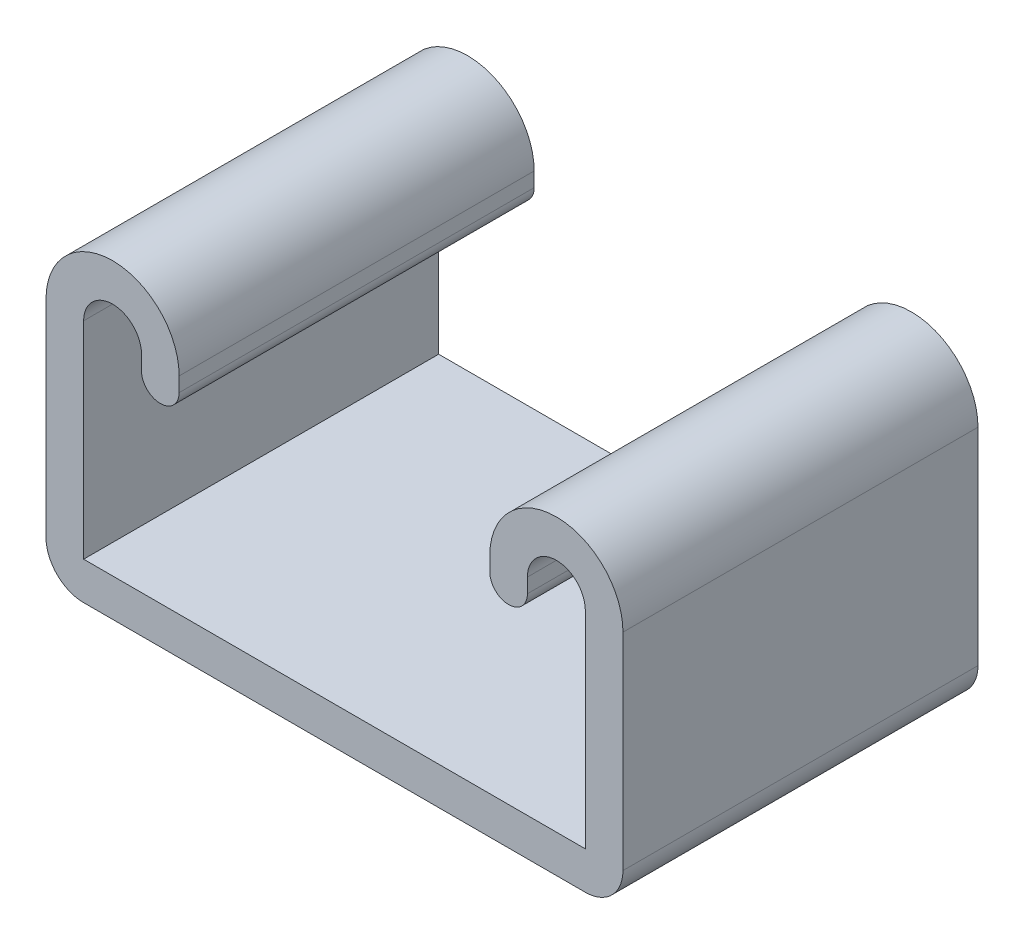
ISO-10303-21;
HEADER;
FILE_DESCRIPTION(('STEP AP214'),'2;1');
FILE_NAME('part.step','',(''),(''),'','','');
FILE_SCHEMA(('AUTOMOTIVE_DESIGN { 1 0 10303 214 1 1 1 1 }'));
ENDSEC;
DATA;
#1=APPLICATION_CONTEXT('core data for automotive mechanical design processes');
#2=APPLICATION_PROTOCOL_DEFINITION('international standard','automotive_design',2000,#1);
#3=PRODUCT_CONTEXT('',#1,'mechanical');
#4=PRODUCT('Part','Part','',(#3));
#5=PRODUCT_RELATED_PRODUCT_CATEGORY('part','',(#4));
#6=PRODUCT_DEFINITION_FORMATION('','',#4);
#7=PRODUCT_DEFINITION_CONTEXT('part definition',#1,'design');
#8=PRODUCT_DEFINITION('design','',#6,#7);
#9=PRODUCT_DEFINITION_SHAPE('','',#8);
#10=(LENGTH_UNIT() NAMED_UNIT(*) SI_UNIT(.MILLI.,.METRE.));
#11=(NAMED_UNIT(*) PLANE_ANGLE_UNIT() SI_UNIT($,.RADIAN.));
#12=(NAMED_UNIT(*) SI_UNIT($,.STERADIAN.) SOLID_ANGLE_UNIT());
#13=UNCERTAINTY_MEASURE_WITH_UNIT(LENGTH_MEASURE(1.E-05),#10,'distance_accuracy_value','');
#14=(GEOMETRIC_REPRESENTATION_CONTEXT(3) GLOBAL_UNCERTAINTY_ASSIGNED_CONTEXT((#13)) GLOBAL_UNIT_ASSIGNED_CONTEXT((#10,
#11,#12)) REPRESENTATION_CONTEXT('',''));
#15=CARTESIAN_POINT('',(0.,0.,0.));
#16=DIRECTION('',(0.,0.,1.));
#17=DIRECTION('',(1.,0.,0.));
#18=AXIS2_PLACEMENT_3D('',#15,#16,#17);
#19=CARTESIAN_POINT('',(-15.875,8.3693,12.7));
#20=DIRECTION('',(0.,0.,-1.));
#21=DIRECTION('',(-1.,0.,0.));
#22=AXIS2_PLACEMENT_3D('',#19,#20,#21);
#23=CYLINDRICAL_SURFACE('',#22,4.7625);
#24=CARTESIAN_POINT('',(-15.875,8.3693,-12.7));
#25=DIRECTION('',(0.,0.,1.));
#26=DIRECTION('',(-1.,0.,0.));
#27=AXIS2_PLACEMENT_3D('',#24,#25,#26);
#28=CIRCLE('',#27,4.7625);
#29=CARTESIAN_POINT('',(-11.1125,8.3693,-12.7));
#30=VERTEX_POINT('',#29);
#31=CARTESIAN_POINT('',(-20.6375,8.3693,-12.7));
#32=VERTEX_POINT('',#31);
#33=EDGE_CURVE('E189',#30,#32,#28,.T.);
#34=ORIENTED_EDGE('',*,*,#33,.T.);
#35=DIRECTION('',(0.,0.,-1.));
#36=VECTOR('',#35,1.);
#37=CARTESIAN_POINT('',(-20.6375,8.3693,12.7));
#38=LINE('',#37,#36);
#39=CARTESIAN_POINT('',(-20.6375,8.3693,12.7));
#40=VERTEX_POINT('',#39);
#41=EDGE_CURVE('E11',#40,#32,#38,.T.);
#42=ORIENTED_EDGE('',*,*,#41,.F.);
#43=CARTESIAN_POINT('',(-15.875,8.3693,12.7));
#44=DIRECTION('',(0.,0.,1.));
#45=DIRECTION('',(-1.,0.,0.));
#46=AXIS2_PLACEMENT_3D('',#43,#44,#45);
#47=CIRCLE('',#46,4.7625);
#48=CARTESIAN_POINT('',(-11.1125,8.3693,12.7));
#49=VERTEX_POINT('',#48);
#50=EDGE_CURVE('E223',#49,#40,#47,.T.);
#51=ORIENTED_EDGE('',*,*,#50,.F.);
#52=DIRECTION('',(0.,0.,-1.));
#53=VECTOR('',#52,1.);
#54=CARTESIAN_POINT('',(-11.1125,8.3693,12.7));
#55=LINE('',#54,#53);
#56=EDGE_CURVE('E185',#49,#30,#55,.T.);
#57=ORIENTED_EDGE('',*,*,#56,.T.);
#58=EDGE_LOOP('',(#34,#42,#51,#57));
#59=FACE_BOUND('',#58,.T.);
#60=ADVANCED_FACE('F33',(#59),#23,.T.);
#61=CARTESIAN_POINT('',(-20.6375,8.3693,12.7));
#62=DIRECTION('',(1.,0.,0.));
#63=DIRECTION('',(0.,1.,0.));
#64=AXIS2_PLACEMENT_3D('',#61,#62,#63);
#65=PLANE('',#64);
#66=DIRECTION('',(0.,-1.,0.));
#67=VECTOR('',#66,1.);
#68=CARTESIAN_POINT('',(-20.6375,8.3693,-12.7));
#69=LINE('',#68,#67);
#70=CARTESIAN_POINT('',(-20.6375,-6.4008,-12.7));
#71=VERTEX_POINT('',#70);
#72=EDGE_CURVE('E192',#32,#71,#69,.T.);
#73=ORIENTED_EDGE('',*,*,#72,.T.);
#74=DIRECTION('',(0.,0.,-1.));
#75=VECTOR('',#74,1.);
#76=CARTESIAN_POINT('',(-20.6375,-6.4008,12.7));
#77=LINE('',#76,#75);
#78=CARTESIAN_POINT('',(-20.6375,-6.4008,12.7));
#79=VERTEX_POINT('',#78);
#80=EDGE_CURVE('E41',#79,#71,#77,.T.);
#81=ORIENTED_EDGE('',*,*,#80,.F.);
#82=DIRECTION('',(0.,-1.,0.));
#83=VECTOR('',#82,1.);
#84=CARTESIAN_POINT('',(-20.6375,8.3693,12.7));
#85=LINE('',#84,#83);
#86=EDGE_CURVE('E122',#40,#79,#85,.T.);
#87=ORIENTED_EDGE('',*,*,#86,.F.);
#88=ORIENTED_EDGE('',*,*,#41,.T.);
#89=EDGE_LOOP('',(#73,#81,#87,#88));
#90=FACE_BOUND('',#89,.T.);
#91=ADVANCED_FACE('F331',(#90),#65,.F.);
#92=CARTESIAN_POINT('',(-17.9451,-6.4008,12.7));
#93=DIRECTION('',(0.,0.,-1.));
#94=DIRECTION('',(-1.,0.,0.));
#95=AXIS2_PLACEMENT_3D('',#92,#93,#94);
#96=CYLINDRICAL_SURFACE('',#95,2.6924);
#97=CARTESIAN_POINT('',(-17.9451,-6.4008,-12.7));
#98=DIRECTION('',(0.,0.,1.));
#99=DIRECTION('',(-1.,0.,0.));
#100=AXIS2_PLACEMENT_3D('',#97,#98,#99);
#101=CIRCLE('',#100,2.6924);
#102=CARTESIAN_POINT('',(-17.9451,-9.0932,-12.7));
#103=VERTEX_POINT('',#102);
#104=EDGE_CURVE('E194',#71,#103,#101,.T.);
#105=ORIENTED_EDGE('',*,*,#104,.T.);
#106=DIRECTION('',(0.,0.,-1.));
#107=VECTOR('',#106,1.);
#108=CARTESIAN_POINT('',(-17.9451,-9.0932,12.7));
#109=LINE('',#108,#107);
#110=CARTESIAN_POINT('',(-17.9451,-9.0932,12.7));
#111=VERTEX_POINT('',#110);
#112=EDGE_CURVE('E260',#111,#103,#109,.T.);
#113=ORIENTED_EDGE('',*,*,#112,.F.);
#114=CARTESIAN_POINT('',(-17.9451,-6.4008,12.7));
#115=DIRECTION('',(0.,0.,1.));
#116=DIRECTION('',(-1.,0.,0.));
#117=AXIS2_PLACEMENT_3D('',#114,#115,#116);
#118=CIRCLE('',#117,2.6924);
#119=EDGE_CURVE('E268',#79,#111,#118,.T.);
#120=ORIENTED_EDGE('',*,*,#119,.F.);
#121=ORIENTED_EDGE('',*,*,#80,.T.);
#122=EDGE_LOOP('',(#105,#113,#120,#121));
#123=FACE_BOUND('',#122,.T.);
#124=ADVANCED_FACE('F266',(#123),#96,.T.);
#125=CARTESIAN_POINT('',(-17.9451,-9.0932,12.7));
#126=DIRECTION('',(0.,1.,0.));
#127=DIRECTION('',(0.,0.,1.));
#128=AXIS2_PLACEMENT_3D('',#125,#126,#127);
#129=PLANE('',#128);
#130=DIRECTION('',(1.,0.,0.));
#131=VECTOR('',#130,1.);
#132=CARTESIAN_POINT('',(-17.9451,-9.0932,-12.7));
#133=LINE('',#132,#131);
#134=CARTESIAN_POINT('',(17.9451,-9.0932,-12.7));
#135=VERTEX_POINT('',#134);
#136=EDGE_CURVE('E196',#103,#135,#133,.T.);
#137=ORIENTED_EDGE('',*,*,#136,.T.);
#138=DIRECTION('',(0.,0.,-1.));
#139=VECTOR('',#138,1.);
#140=CARTESIAN_POINT('',(17.9451,-9.0932,12.7));
#141=LINE('',#140,#139);
#142=CARTESIAN_POINT('',(17.9451,-9.0932,12.7));
#143=VERTEX_POINT('',#142);
#144=EDGE_CURVE('E257',#143,#135,#141,.T.);
#145=ORIENTED_EDGE('',*,*,#144,.F.);
#146=DIRECTION('',(1.,0.,0.));
#147=VECTOR('',#146,1.);
#148=CARTESIAN_POINT('',(-17.9451,-9.0932,12.7));
#149=LINE('',#148,#147);
#150=EDGE_CURVE('E286',#111,#143,#149,.T.);
#151=ORIENTED_EDGE('',*,*,#150,.F.);
#152=ORIENTED_EDGE('',*,*,#112,.T.);
#153=EDGE_LOOP('',(#137,#145,#151,#152));
#154=FACE_BOUND('',#153,.T.);
#155=ADVANCED_FACE('F277',(#154),#129,.F.);
#156=CARTESIAN_POINT('',(17.9451,-6.4008,12.7));
#157=DIRECTION('',(0.,0.,-1.));
#158=DIRECTION('',(-1.,0.,0.));
#159=AXIS2_PLACEMENT_3D('',#156,#157,#158);
#160=CYLINDRICAL_SURFACE('',#159,2.6924);
#161=CARTESIAN_POINT('',(17.9451,-6.4008,-12.7));
#162=DIRECTION('',(0.,0.,1.));
#163=DIRECTION('',(1.,0.,0.));
#164=AXIS2_PLACEMENT_3D('',#161,#162,#163);
#165=CIRCLE('',#164,2.6924);
#166=CARTESIAN_POINT('',(20.6375,-6.4008,-12.7));
#167=VERTEX_POINT('',#166);
#168=EDGE_CURVE('E198',#135,#167,#165,.T.);
#169=ORIENTED_EDGE('',*,*,#168,.T.);
#170=DIRECTION('',(0.,0.,-1.));
#171=VECTOR('',#170,1.);
#172=CARTESIAN_POINT('',(20.6375,-6.4008,12.7));
#173=LINE('',#172,#171);
#174=CARTESIAN_POINT('',(20.6375,-6.4008,12.7));
#175=VERTEX_POINT('',#174);
#176=EDGE_CURVE('E254',#175,#167,#173,.T.);
#177=ORIENTED_EDGE('',*,*,#176,.F.);
#178=CARTESIAN_POINT('',(17.9451,-6.4008,12.7));
#179=DIRECTION('',(0.,0.,1.));
#180=DIRECTION('',(1.,0.,0.));
#181=AXIS2_PLACEMENT_3D('',#178,#179,#180);
#182=CIRCLE('',#181,2.6924);
#183=EDGE_CURVE('E283',#143,#175,#182,.T.);
#184=ORIENTED_EDGE('',*,*,#183,.F.);
#185=ORIENTED_EDGE('',*,*,#144,.T.);
#186=EDGE_LOOP('',(#169,#177,#184,#185));
#187=FACE_BOUND('',#186,.T.);
#188=ADVANCED_FACE('F281',(#187),#160,.T.);
#189=CARTESIAN_POINT('',(20.6375,-6.4008,12.7));
#190=DIRECTION('',(-1.,0.,0.));
#191=DIRECTION('',(0.,-1.,0.));
#192=AXIS2_PLACEMENT_3D('',#189,#190,#191);
#193=PLANE('',#192);
#194=DIRECTION('',(0.,1.,0.));
#195=VECTOR('',#194,1.);
#196=CARTESIAN_POINT('',(20.6375,-6.4008,-12.7));
#197=LINE('',#196,#195);
#198=CARTESIAN_POINT('',(20.6375,8.3693,-12.7));
#199=VERTEX_POINT('',#198);
#200=EDGE_CURVE('E200',#167,#199,#197,.T.);
#201=ORIENTED_EDGE('',*,*,#200,.T.);
#202=DIRECTION('',(0.,0.,-1.));
#203=VECTOR('',#202,1.);
#204=CARTESIAN_POINT('',(20.6375,8.3693,12.7));
#205=LINE('',#204,#203);
#206=CARTESIAN_POINT('',(20.6375,8.3693,12.7));
#207=VERTEX_POINT('',#206);
#208=EDGE_CURVE('E251',#207,#199,#205,.T.);
#209=ORIENTED_EDGE('',*,*,#208,.F.);
#210=DIRECTION('',(0.,1.,0.));
#211=VECTOR('',#210,1.);
#212=CARTESIAN_POINT('',(20.6375,-6.4008,12.7));
#213=LINE('',#212,#211);
#214=EDGE_CURVE('E285',#175,#207,#213,.T.);
#215=ORIENTED_EDGE('',*,*,#214,.F.);
#216=ORIENTED_EDGE('',*,*,#176,.T.);
#217=EDGE_LOOP('',(#201,#209,#215,#216));
#218=FACE_BOUND('',#217,.T.);
#219=ADVANCED_FACE('F344',(#218),#193,.F.);
#220=CARTESIAN_POINT('',(15.875,8.3693,12.7));
#221=DIRECTION('',(0.,0.,-1.));
#222=DIRECTION('',(-1.,0.,0.));
#223=AXIS2_PLACEMENT_3D('',#220,#221,#222);
#224=CYLINDRICAL_SURFACE('',#223,4.7625);
#225=CARTESIAN_POINT('',(15.875,8.3693,-12.7));
#226=DIRECTION('',(0.,0.,1.));
#227=DIRECTION('',(1.,0.,0.));
#228=AXIS2_PLACEMENT_3D('',#225,#226,#227);
#229=CIRCLE('',#228,4.7625);
#230=CARTESIAN_POINT('',(11.1125,8.3693,-12.7));
#231=VERTEX_POINT('',#230);
#232=EDGE_CURVE('E202',#199,#231,#229,.T.);
#233=ORIENTED_EDGE('',*,*,#232,.T.);
#234=DIRECTION('',(0.,0.,-1.));
#235=VECTOR('',#234,1.);
#236=CARTESIAN_POINT('',(11.1125,8.3693,12.7));
#237=LINE('',#236,#235);
#238=CARTESIAN_POINT('',(11.1125,8.3693,12.7));
#239=VERTEX_POINT('',#238);
#240=EDGE_CURVE('E248',#239,#231,#237,.T.);
#241=ORIENTED_EDGE('',*,*,#240,.F.);
#242=CARTESIAN_POINT('',(15.875,8.3693,12.7));
#243=DIRECTION('',(0.,0.,1.));
#244=DIRECTION('',(1.,0.,0.));
#245=AXIS2_PLACEMENT_3D('',#242,#243,#244);
#246=CIRCLE('',#245,4.7625);
#247=EDGE_CURVE('E288',#207,#239,#246,.T.);
#248=ORIENTED_EDGE('',*,*,#247,.F.);
#249=ORIENTED_EDGE('',*,*,#208,.T.);
#250=EDGE_LOOP('',(#233,#241,#248,#249));
#251=FACE_BOUND('',#250,.T.);
#252=ADVANCED_FACE('F347',(#251),#224,.T.);
#253=CARTESIAN_POINT('',(11.1125,8.3693,12.7));
#254=DIRECTION('',(1.,0.,0.));
#255=DIRECTION('',(0.,0.,-1.));
#256=AXIS2_PLACEMENT_3D('',#253,#254,#255);
#257=PLANE('',#256);
#258=DIRECTION('',(0.,-1.,0.));
#259=VECTOR('',#258,1.);
#260=CARTESIAN_POINT('',(11.1125,8.3693,-12.7));
#261=LINE('',#260,#259);
#262=CARTESIAN_POINT('',(11.1125,7.33425,-12.7));
#263=VERTEX_POINT('',#262);
#264=EDGE_CURVE('E204',#231,#263,#261,.T.);
#265=ORIENTED_EDGE('',*,*,#264,.T.);
#266=DIRECTION('',(0.,0.,-1.));
#267=VECTOR('',#266,1.);
#268=CARTESIAN_POINT('',(11.1125,7.33425,12.7));
#269=LINE('',#268,#267);
#270=CARTESIAN_POINT('',(11.1125,7.33425,12.7));
#271=VERTEX_POINT('',#270);
#272=EDGE_CURVE('E245',#271,#263,#269,.T.);
#273=ORIENTED_EDGE('',*,*,#272,.F.);
#274=DIRECTION('',(0.,-1.,0.));
#275=VECTOR('',#274,1.);
#276=CARTESIAN_POINT('',(11.1125,8.3693,12.7));
#277=LINE('',#276,#275);
#278=EDGE_CURVE('E294',#239,#271,#277,.T.);
#279=ORIENTED_EDGE('',*,*,#278,.F.);
#280=ORIENTED_EDGE('',*,*,#240,.T.);
#281=EDGE_LOOP('',(#265,#273,#279,#280));
#282=FACE_BOUND('',#281,.T.);
#283=ADVANCED_FACE('F351',(#282),#257,.F.);
#284=CARTESIAN_POINT('',(12.4587,7.33425,12.7));
#285=DIRECTION('',(0.,0.,-1.));
#286=DIRECTION('',(-1.,0.,0.));
#287=AXIS2_PLACEMENT_3D('',#284,#285,#286);
#288=CYLINDRICAL_SURFACE('',#287,1.3462);
#289=CARTESIAN_POINT('',(12.4587,7.33425,-12.7));
#290=DIRECTION('',(0.,0.,1.));
#291=DIRECTION('',(1.,0.,0.));
#292=AXIS2_PLACEMENT_3D('',#289,#290,#291);
#293=CIRCLE('',#292,1.3462);
#294=CARTESIAN_POINT('',(13.8049,7.33425,-12.7));
#295=VERTEX_POINT('',#294);
#296=EDGE_CURVE('E206',#263,#295,#293,.T.);
#297=ORIENTED_EDGE('',*,*,#296,.T.);
#298=DIRECTION('',(0.,0.,-1.));
#299=VECTOR('',#298,1.);
#300=CARTESIAN_POINT('',(13.8049,7.33425,12.7));
#301=LINE('',#300,#299);
#302=CARTESIAN_POINT('',(13.8049,7.33425,12.7));
#303=VERTEX_POINT('',#302);
#304=EDGE_CURVE('E242',#303,#295,#301,.T.);
#305=ORIENTED_EDGE('',*,*,#304,.F.);
#306=CARTESIAN_POINT('',(12.4587,7.33425,12.7));
#307=DIRECTION('',(0.,0.,1.));
#308=DIRECTION('',(1.,0.,0.));
#309=AXIS2_PLACEMENT_3D('',#306,#307,#308);
#310=CIRCLE('',#309,1.3462);
#311=EDGE_CURVE('E296',#271,#303,#310,.T.);
#312=ORIENTED_EDGE('',*,*,#311,.F.);
#313=ORIENTED_EDGE('',*,*,#272,.T.);
#314=EDGE_LOOP('',(#297,#305,#312,#313));
#315=FACE_BOUND('',#314,.T.);
#316=ADVANCED_FACE('F355',(#315),#288,.T.);
#317=CARTESIAN_POINT('',(13.8049,8.3693,12.7));
#318=DIRECTION('',(-1.,0.,0.));
#319=DIRECTION('',(0.,0.,1.));
#320=AXIS2_PLACEMENT_3D('',#317,#318,#319);
#321=PLANE('',#320);
#322=DIRECTION('',(0.,1.,0.));
#323=VECTOR('',#322,1.);
#324=CARTESIAN_POINT('',(13.8049,8.3693,-12.7));
#325=LINE('',#324,#323);
#326=CARTESIAN_POINT('',(13.8049,8.3693,-12.7));
#327=VERTEX_POINT('',#326);
#328=EDGE_CURVE('E208',#295,#327,#325,.T.);
#329=ORIENTED_EDGE('',*,*,#328,.T.);
#330=DIRECTION('',(0.,0.,-1.));
#331=VECTOR('',#330,1.);
#332=CARTESIAN_POINT('',(13.8049,8.3693,12.7));
#333=LINE('',#332,#331);
#334=CARTESIAN_POINT('',(13.8049,8.3693,12.7));
#335=VERTEX_POINT('',#334);
#336=EDGE_CURVE('E239',#335,#327,#333,.T.);
#337=ORIENTED_EDGE('',*,*,#336,.F.);
#338=DIRECTION('',(0.,1.,0.));
#339=VECTOR('',#338,1.);
#340=CARTESIAN_POINT('',(13.8049,8.3693,12.7));
#341=LINE('',#340,#339);
#342=EDGE_CURVE('E298',#303,#335,#341,.T.);
#343=ORIENTED_EDGE('',*,*,#342,.F.);
#344=ORIENTED_EDGE('',*,*,#304,.T.);
#345=EDGE_LOOP('',(#329,#337,#343,#344));
#346=FACE_BOUND('',#345,.T.);
#347=ADVANCED_FACE('F359',(#346),#321,.F.);
#348=CARTESIAN_POINT('',(15.875,8.3693,12.7));
#349=DIRECTION('',(0.,0.,-1.));
#350=DIRECTION('',(-1.,0.,0.));
#351=AXIS2_PLACEMENT_3D('',#348,#349,#350);
#352=CYLINDRICAL_SURFACE('',#351,2.0701);
#353=CARTESIAN_POINT('',(15.875,8.3693,-12.7));
#354=DIRECTION('',(0.,0.,-1.));
#355=DIRECTION('',(1.,0.,0.));
#356=AXIS2_PLACEMENT_3D('',#353,#354,#355);
#357=CIRCLE('',#356,2.0701);
#358=CARTESIAN_POINT('',(17.9451,8.3693,-12.7));
#359=VERTEX_POINT('',#358);
#360=EDGE_CURVE('E210',#327,#359,#357,.T.);
#361=ORIENTED_EDGE('',*,*,#360,.T.);
#362=DIRECTION('',(0.,0.,-1.));
#363=VECTOR('',#362,1.);
#364=CARTESIAN_POINT('',(17.9451,8.3693,12.7));
#365=LINE('',#364,#363);
#366=CARTESIAN_POINT('',(17.9451,8.3693,12.7));
#367=VERTEX_POINT('',#366);
#368=EDGE_CURVE('E236',#367,#359,#365,.T.);
#369=ORIENTED_EDGE('',*,*,#368,.F.);
#370=CARTESIAN_POINT('',(15.875,8.3693,12.7));
#371=DIRECTION('',(0.,0.,-1.));
#372=DIRECTION('',(1.,0.,0.));
#373=AXIS2_PLACEMENT_3D('',#370,#371,#372);
#374=CIRCLE('',#373,2.0701);
#375=EDGE_CURVE('E300',#335,#367,#374,.T.);
#376=ORIENTED_EDGE('',*,*,#375,.F.);
#377=ORIENTED_EDGE('',*,*,#336,.T.);
#378=EDGE_LOOP('',(#361,#369,#376,#377));
#379=FACE_BOUND('',#378,.T.);
#380=ADVANCED_FACE('F363',(#379),#352,.F.);
#381=CARTESIAN_POINT('',(17.9451,-6.4008,12.7));
#382=DIRECTION('',(1.,0.,0.));
#383=DIRECTION('',(0.,1.,0.));
#384=AXIS2_PLACEMENT_3D('',#381,#382,#383);
#385=PLANE('',#384);
#386=DIRECTION('',(0.,-1.,0.));
#387=VECTOR('',#386,1.);
#388=CARTESIAN_POINT('',(17.9451,-6.4008,-12.7));
#389=LINE('',#388,#387);
#390=CARTESIAN_POINT('',(17.9451,-6.4008,-12.7));
#391=VERTEX_POINT('',#390);
#392=EDGE_CURVE('E212',#359,#391,#389,.T.);
#393=ORIENTED_EDGE('',*,*,#392,.T.);
#394=DIRECTION('',(0.,0.,-1.));
#395=VECTOR('',#394,1.);
#396=CARTESIAN_POINT('',(17.9451,-6.4008,12.7));
#397=LINE('',#396,#395);
#398=CARTESIAN_POINT('',(17.9451,-6.4008,12.7));
#399=VERTEX_POINT('',#398);
#400=EDGE_CURVE('E233',#399,#391,#397,.T.);
#401=ORIENTED_EDGE('',*,*,#400,.F.);
#402=DIRECTION('',(0.,-1.,0.));
#403=VECTOR('',#402,1.);
#404=CARTESIAN_POINT('',(17.9451,-6.4008,12.7));
#405=LINE('',#404,#403);
#406=EDGE_CURVE('E302',#367,#399,#405,.T.);
#407=ORIENTED_EDGE('',*,*,#406,.F.);
#408=ORIENTED_EDGE('',*,*,#368,.T.);
#409=EDGE_LOOP('',(#393,#401,#407,#408));
#410=FACE_BOUND('',#409,.T.);
#411=ADVANCED_FACE('F367',(#410),#385,.F.);
#412=CARTESIAN_POINT('',(-17.9451,-6.4008,12.7));
#413=DIRECTION('',(0.,-1.,0.));
#414=DIRECTION('',(0.,0.,-1.));
#415=AXIS2_PLACEMENT_3D('',#412,#413,#414);
#416=PLANE('',#415);
#417=DIRECTION('',(-1.,0.,0.));
#418=VECTOR('',#417,1.);
#419=CARTESIAN_POINT('',(-17.9451,-6.4008,-12.7));
#420=LINE('',#419,#418);
#421=CARTESIAN_POINT('',(-17.9451,-6.4008,-12.7));
#422=VERTEX_POINT('',#421);
#423=EDGE_CURVE('E214',#391,#422,#420,.T.);
#424=ORIENTED_EDGE('',*,*,#423,.T.);
#425=DIRECTION('',(0.,0.,-1.));
#426=VECTOR('',#425,1.);
#427=CARTESIAN_POINT('',(-17.9451,-6.4008,12.7));
#428=LINE('',#427,#426);
#429=CARTESIAN_POINT('',(-17.9451,-6.4008,12.7));
#430=VERTEX_POINT('',#429);
#431=EDGE_CURVE('E230',#430,#422,#428,.T.);
#432=ORIENTED_EDGE('',*,*,#431,.F.);
#433=DIRECTION('',(-1.,0.,0.));
#434=VECTOR('',#433,1.);
#435=CARTESIAN_POINT('',(-17.9451,-6.4008,12.7));
#436=LINE('',#435,#434);
#437=EDGE_CURVE('E304',#399,#430,#436,.T.);
#438=ORIENTED_EDGE('',*,*,#437,.F.);
#439=ORIENTED_EDGE('',*,*,#400,.T.);
#440=EDGE_LOOP('',(#424,#432,#438,#439));
#441=FACE_BOUND('',#440,.T.);
#442=ADVANCED_FACE('F371',(#441),#416,.F.);
#443=CARTESIAN_POINT('',(-17.9451,8.3693,12.7));
#444=DIRECTION('',(-1.,0.,0.));
#445=DIRECTION('',(0.,-1.,0.));
#446=AXIS2_PLACEMENT_3D('',#443,#444,#445);
#447=PLANE('',#446);
#448=DIRECTION('',(0.,1.,0.));
#449=VECTOR('',#448,1.);
#450=CARTESIAN_POINT('',(-17.9451,8.3693,-12.7));
#451=LINE('',#450,#449);
#452=CARTESIAN_POINT('',(-17.9451,8.3693,-12.7));
#453=VERTEX_POINT('',#452);
#454=EDGE_CURVE('E216',#422,#453,#451,.T.);
#455=ORIENTED_EDGE('',*,*,#454,.T.);
#456=DIRECTION('',(0.,0.,-1.));
#457=VECTOR('',#456,1.);
#458=CARTESIAN_POINT('',(-17.9451,8.3693,12.7));
#459=LINE('',#458,#457);
#460=CARTESIAN_POINT('',(-17.9451,8.3693,12.7));
#461=VERTEX_POINT('',#460);
#462=EDGE_CURVE('E227',#461,#453,#459,.T.);
#463=ORIENTED_EDGE('',*,*,#462,.F.);
#464=DIRECTION('',(0.,1.,0.));
#465=VECTOR('',#464,1.);
#466=CARTESIAN_POINT('',(-17.9451,8.3693,12.7));
#467=LINE('',#466,#465);
#468=EDGE_CURVE('E306',#430,#461,#467,.T.);
#469=ORIENTED_EDGE('',*,*,#468,.F.);
#470=ORIENTED_EDGE('',*,*,#431,.T.);
#471=EDGE_LOOP('',(#455,#463,#469,#470));
#472=FACE_BOUND('',#471,.T.);
#473=ADVANCED_FACE('F312',(#472),#447,.F.);
#474=CARTESIAN_POINT('',(-15.875,8.3693,12.7));
#475=DIRECTION('',(0.,0.,-1.));
#476=DIRECTION('',(-1.,0.,0.));
#477=AXIS2_PLACEMENT_3D('',#474,#475,#476);
#478=CYLINDRICAL_SURFACE('',#477,2.0701);
#479=CARTESIAN_POINT('',(-15.875,8.3693,-12.7));
#480=DIRECTION('',(0.,0.,-1.));
#481=DIRECTION('',(-1.,0.,0.));
#482=AXIS2_PLACEMENT_3D('',#479,#480,#481);
#483=CIRCLE('',#482,2.0701);
#484=CARTESIAN_POINT('',(-13.8049,8.3693,-12.7));
#485=VERTEX_POINT('',#484);
#486=EDGE_CURVE('E218',#453,#485,#483,.T.);
#487=ORIENTED_EDGE('',*,*,#486,.T.);
#488=DIRECTION('',(0.,0.,-1.));
#489=VECTOR('',#488,1.);
#490=CARTESIAN_POINT('',(-13.8049,8.3693,12.7));
#491=LINE('',#490,#489);
#492=CARTESIAN_POINT('',(-13.8049,8.3693,12.7));
#493=VERTEX_POINT('',#492);
#494=EDGE_CURVE('E180',#493,#485,#491,.T.);
#495=ORIENTED_EDGE('',*,*,#494,.F.);
#496=CARTESIAN_POINT('',(-15.875,8.3693,12.7));
#497=DIRECTION('',(0.,0.,-1.));
#498=DIRECTION('',(-1.,0.,0.));
#499=AXIS2_PLACEMENT_3D('',#496,#497,#498);
#500=CIRCLE('',#499,2.0701);
#501=EDGE_CURVE('E171',#461,#493,#500,.T.);
#502=ORIENTED_EDGE('',*,*,#501,.F.);
#503=ORIENTED_EDGE('',*,*,#462,.T.);
#504=EDGE_LOOP('',(#487,#495,#502,#503));
#505=FACE_BOUND('',#504,.T.);
#506=ADVANCED_FACE('F316',(#505),#478,.F.);
#507=CARTESIAN_POINT('',(-13.8049,8.3693,12.7));
#508=DIRECTION('',(1.,0.,0.));
#509=DIRECTION('',(0.,1.,0.));
#510=AXIS2_PLACEMENT_3D('',#507,#508,#509);
#511=PLANE('',#510);
#512=DIRECTION('',(0.,-1.,0.));
#513=VECTOR('',#512,1.);
#514=CARTESIAN_POINT('',(-13.8049,8.3693,-12.7));
#515=LINE('',#514,#513);
#516=CARTESIAN_POINT('',(-13.8049,7.33425,-12.7));
#517=VERTEX_POINT('',#516);
#518=EDGE_CURVE('E179',#485,#517,#515,.T.);
#519=ORIENTED_EDGE('',*,*,#518,.T.);
#520=DIRECTION('',(0.,0.,-1.));
#521=VECTOR('',#520,1.);
#522=CARTESIAN_POINT('',(-13.8049,7.33425,12.7));
#523=LINE('',#522,#521);
#524=CARTESIAN_POINT('',(-13.8049,7.33425,12.7));
#525=VERTEX_POINT('',#524);
#526=EDGE_CURVE('E176',#525,#517,#523,.T.);
#527=ORIENTED_EDGE('',*,*,#526,.F.);
#528=DIRECTION('',(0.,-1.,0.));
#529=VECTOR('',#528,1.);
#530=CARTESIAN_POINT('',(-13.8049,8.3693,12.7));
#531=LINE('',#530,#529);
#532=EDGE_CURVE('E165',#493,#525,#531,.T.);
#533=ORIENTED_EDGE('',*,*,#532,.F.);
#534=ORIENTED_EDGE('',*,*,#494,.T.);
#535=EDGE_LOOP('',(#519,#527,#533,#534));
#536=FACE_BOUND('',#535,.T.);
#537=ADVANCED_FACE('F177',(#536),#511,.F.);
#538=CARTESIAN_POINT('',(-12.4587,7.33425,12.7));
#539=DIRECTION('',(0.,0.,-1.));
#540=DIRECTION('',(-1.,0.,0.));
#541=AXIS2_PLACEMENT_3D('',#538,#539,#540);
#542=CYLINDRICAL_SURFACE('',#541,1.3462);
#543=CARTESIAN_POINT('',(-12.4587,7.33425,-12.7));
#544=DIRECTION('',(0.,0.,1.));
#545=DIRECTION('',(-1.,0.,0.));
#546=AXIS2_PLACEMENT_3D('',#543,#544,#545);
#547=CIRCLE('',#546,1.3462);
#548=CARTESIAN_POINT('',(-11.1125,7.33425,-12.7));
#549=VERTEX_POINT('',#548);
#550=EDGE_CURVE('E108',#517,#549,#547,.T.);
#551=ORIENTED_EDGE('',*,*,#550,.T.);
#552=DIRECTION('',(0.,0.,-1.));
#553=VECTOR('',#552,1.);
#554=CARTESIAN_POINT('',(-11.1125,7.33425,12.7));
#555=LINE('',#554,#553);
#556=CARTESIAN_POINT('',(-11.1125,7.33425,12.7));
#557=VERTEX_POINT('',#556);
#558=EDGE_CURVE('E181',#557,#549,#555,.T.);
#559=ORIENTED_EDGE('',*,*,#558,.F.);
#560=CARTESIAN_POINT('',(-12.4587,7.33425,12.7));
#561=DIRECTION('',(0.,0.,1.));
#562=DIRECTION('',(-1.,0.,0.));
#563=AXIS2_PLACEMENT_3D('',#560,#561,#562);
#564=CIRCLE('',#563,1.3462);
#565=EDGE_CURVE('E169',#525,#557,#564,.T.);
#566=ORIENTED_EDGE('',*,*,#565,.F.);
#567=ORIENTED_EDGE('',*,*,#526,.T.);
#568=EDGE_LOOP('',(#551,#559,#566,#567));
#569=FACE_BOUND('',#568,.T.);
#570=ADVANCED_FACE('F183',(#569),#542,.T.);
#571=CARTESIAN_POINT('',(-11.1125,8.3693,12.7));
#572=DIRECTION('',(-1.,0.,0.));
#573=DIRECTION('',(0.,0.,1.));
#574=AXIS2_PLACEMENT_3D('',#571,#572,#573);
#575=PLANE('',#574);
#576=DIRECTION('',(0.,1.,0.));
#577=VECTOR('',#576,1.);
#578=CARTESIAN_POINT('',(-11.1125,8.3693,-12.7));
#579=LINE('',#578,#577);
#580=EDGE_CURVE('E114',#549,#30,#579,.T.);
#581=ORIENTED_EDGE('',*,*,#580,.T.);
#582=ORIENTED_EDGE('',*,*,#56,.F.);
#583=DIRECTION('',(0.,1.,0.));
#584=VECTOR('',#583,1.);
#585=CARTESIAN_POINT('',(-11.1125,8.3693,12.7));
#586=LINE('',#585,#584);
#587=EDGE_CURVE('E49',#557,#49,#586,.T.);
#588=ORIENTED_EDGE('',*,*,#587,.F.);
#589=ORIENTED_EDGE('',*,*,#558,.T.);
#590=EDGE_LOOP('',(#581,#582,#588,#589));
#591=FACE_BOUND('',#590,.T.);
#592=ADVANCED_FACE('F320',(#591),#575,.F.);
#593=CARTESIAN_POINT('',(-15.875,8.3693,12.7));
#594=DIRECTION('',(0.,0.,-1.));
#595=DIRECTION('',(-1.,0.,0.));
#596=AXIS2_PLACEMENT_3D('',#593,#594,#595);
#597=PLANE('',#596);
#598=ORIENTED_EDGE('',*,*,#50,.T.);
#599=ORIENTED_EDGE('',*,*,#86,.T.);
#600=ORIENTED_EDGE('',*,*,#119,.T.);
#601=ORIENTED_EDGE('',*,*,#150,.T.);
#602=ORIENTED_EDGE('',*,*,#183,.T.);
#603=ORIENTED_EDGE('',*,*,#214,.T.);
#604=ORIENTED_EDGE('',*,*,#247,.T.);
#605=ORIENTED_EDGE('',*,*,#278,.T.);
#606=ORIENTED_EDGE('',*,*,#311,.T.);
#607=ORIENTED_EDGE('',*,*,#342,.T.);
#608=ORIENTED_EDGE('',*,*,#375,.T.);
#609=ORIENTED_EDGE('',*,*,#406,.T.);
#610=ORIENTED_EDGE('',*,*,#437,.T.);
#611=ORIENTED_EDGE('',*,*,#468,.T.);
#612=ORIENTED_EDGE('',*,*,#501,.T.);
#613=ORIENTED_EDGE('',*,*,#532,.T.);
#614=ORIENTED_EDGE('',*,*,#565,.T.);
#615=ORIENTED_EDGE('',*,*,#587,.T.);
#616=EDGE_LOOP('',(#598,#599,#600,#601,#602,#603,#604,#605,#606,#607,#608,#609,#610,#611,#612,
#613,#614,#615));
#617=FACE_BOUND('',#616,.T.);
#618=ADVANCED_FACE('F167',(#617),#597,.F.);
#619=CARTESIAN_POINT('',(-15.875,8.3693,-12.7));
#620=DIRECTION('',(0.,0.,-1.));
#621=DIRECTION('',(-1.,0.,0.));
#622=AXIS2_PLACEMENT_3D('',#619,#620,#621);
#623=PLANE('',#622);
#624=ORIENTED_EDGE('',*,*,#33,.F.);
#625=ORIENTED_EDGE('',*,*,#580,.F.);
#626=ORIENTED_EDGE('',*,*,#550,.F.);
#627=ORIENTED_EDGE('',*,*,#518,.F.);
#628=ORIENTED_EDGE('',*,*,#486,.F.);
#629=ORIENTED_EDGE('',*,*,#454,.F.);
#630=ORIENTED_EDGE('',*,*,#423,.F.);
#631=ORIENTED_EDGE('',*,*,#392,.F.);
#632=ORIENTED_EDGE('',*,*,#360,.F.);
#633=ORIENTED_EDGE('',*,*,#328,.F.);
#634=ORIENTED_EDGE('',*,*,#296,.F.);
#635=ORIENTED_EDGE('',*,*,#264,.F.);
#636=ORIENTED_EDGE('',*,*,#232,.F.);
#637=ORIENTED_EDGE('',*,*,#200,.F.);
#638=ORIENTED_EDGE('',*,*,#168,.F.);
#639=ORIENTED_EDGE('',*,*,#136,.F.);
#640=ORIENTED_EDGE('',*,*,#104,.F.);
#641=ORIENTED_EDGE('',*,*,#72,.F.);
#642=EDGE_LOOP('',(#624,#625,#626,#627,#628,#629,#630,#631,#632,#633,#634,#635,#636,#637,#638,
#639,#640,#641));
#643=FACE_BOUND('',#642,.T.);
#644=ADVANCED_FACE('F272',(#643),#623,.T.);
#645=CLOSED_SHELL('',(#60,#91,#124,#155,#188,#219,#252,#283,#316,#347,#380,#411,#442,#473,#506,
#537,#570,#592,#618,#644));
#646=MANIFOLD_SOLID_BREP('B2',#645);
#647=ADVANCED_BREP_SHAPE_REPRESENTATION('',(#18,#646),#14);
#648=SHAPE_DEFINITION_REPRESENTATION(#9,#647);
ENDSEC;
END-ISO-10303-21;
